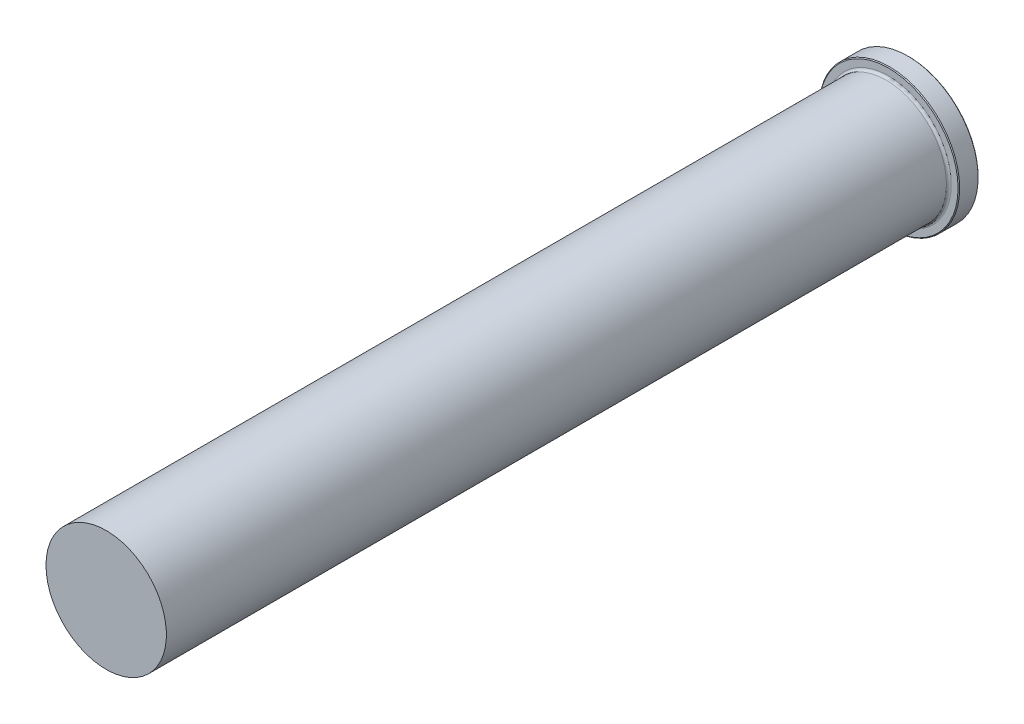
ISO-10303-21;
HEADER;
FILE_DESCRIPTION(('STEP AP214'),'2;1');
FILE_NAME('part.step','',(''),(''),'','','');
FILE_SCHEMA(('AUTOMOTIVE_DESIGN { 1 0 10303 214 1 1 1 1 }'));
ENDSEC;
DATA;
#1=APPLICATION_CONTEXT('core data for automotive mechanical design processes');
#2=APPLICATION_PROTOCOL_DEFINITION('international standard','automotive_design',2000,#1);
#3=PRODUCT_CONTEXT('',#1,'mechanical');
#4=PRODUCT('Part','Part','',(#3));
#5=PRODUCT_RELATED_PRODUCT_CATEGORY('part','',(#4));
#6=PRODUCT_DEFINITION_FORMATION('','',#4);
#7=PRODUCT_DEFINITION_CONTEXT('part definition',#1,'design');
#8=PRODUCT_DEFINITION('design','',#6,#7);
#9=PRODUCT_DEFINITION_SHAPE('','',#8);
#10=(LENGTH_UNIT() NAMED_UNIT(*) SI_UNIT(.MILLI.,.METRE.));
#11=(NAMED_UNIT(*) PLANE_ANGLE_UNIT() SI_UNIT($,.RADIAN.));
#12=(NAMED_UNIT(*) SI_UNIT($,.STERADIAN.) SOLID_ANGLE_UNIT());
#13=UNCERTAINTY_MEASURE_WITH_UNIT(LENGTH_MEASURE(1.E-05),#10,'distance_accuracy_value','');
#14=(GEOMETRIC_REPRESENTATION_CONTEXT(3) GLOBAL_UNCERTAINTY_ASSIGNED_CONTEXT((#13)) GLOBAL_UNIT_ASSIGNED_CONTEXT((#10,
#11,#12)) REPRESENTATION_CONTEXT('',''));
#15=CARTESIAN_POINT('',(0.,0.,0.));
#16=DIRECTION('',(0.,0.,1.));
#17=DIRECTION('',(1.,0.,0.));
#18=AXIS2_PLACEMENT_3D('',#15,#16,#17);
#19=CARTESIAN_POINT('',(0.,0.,0.));
#20=DIRECTION('',(0.,0.,-1.));
#21=DIRECTION('',(-1.,0.,0.));
#22=AXIS2_PLACEMENT_3D('',#19,#20,#21);
#23=PLANE('',#22);
#24=CARTESIAN_POINT('',(0.,0.,0.));
#25=DIRECTION('',(0.,0.,-1.));
#26=DIRECTION('',(-1.,0.,0.));
#27=AXIS2_PLACEMENT_3D('',#24,#25,#26);
#28=CIRCLE('',#27,21.971);
#29=CARTESIAN_POINT('',(-21.971,0.,0.));
#30=VERTEX_POINT('',#29);
#31=EDGE_CURVE('E50',#30,#30,#28,.T.);
#32=ORIENTED_EDGE('',*,*,#31,.T.);
#33=EDGE_LOOP('',(#32));
#34=FACE_BOUND('',#33,.T.);
#35=ADVANCED_FACE('F35',(#34),#23,.T.);
#36=CARTESIAN_POINT('',(0.,0.,0.));
#37=DIRECTION('',(0.,0.,-1.));
#38=DIRECTION('',(-1.,0.,0.));
#39=AXIS2_PLACEMENT_3D('',#36,#37,#38);
#40=CYLINDRICAL_SURFACE('',#39,22.225);
#41=CARTESIAN_POINT('',(0.,0.,0.254000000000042));
#42=DIRECTION('',(0.,0.,-1.));
#43=DIRECTION('',(-1.,0.,0.));
#44=AXIS2_PLACEMENT_3D('',#41,#42,#43);
#45=CIRCLE('',#44,22.225);
#46=CARTESIAN_POINT('',(-22.225,0.,0.254000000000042));
#47=VERTEX_POINT('',#46);
#48=EDGE_CURVE('E42',#47,#47,#45,.F.);
#49=ORIENTED_EDGE('',*,*,#48,.T.);
#50=EDGE_LOOP('',(#49));
#51=FACE_BOUND('',#50,.T.);
#52=CARTESIAN_POINT('',(0.,0.,6.09600000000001));
#53=DIRECTION('',(0.,0.,1.));
#54=DIRECTION('',(1.,0.,0.));
#55=AXIS2_PLACEMENT_3D('',#52,#53,#54);
#56=CIRCLE('',#55,22.225);
#57=CARTESIAN_POINT('',(22.225,0.,6.09600000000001));
#58=VERTEX_POINT('',#57);
#59=EDGE_CURVE('E46',#58,#58,#56,.F.);
#60=ORIENTED_EDGE('',*,*,#59,.T.);
#61=EDGE_LOOP('',(#60));
#62=FACE_BOUND('',#61,.T.);
#63=ADVANCED_FACE('F82',(#51,#62),#40,.T.);
#64=CARTESIAN_POINT('',(0.,22.225,6.35));
#65=DIRECTION('',(0.,0.,1.));
#66=DIRECTION('',(1.,0.,0.));
#67=AXIS2_PLACEMENT_3D('',#64,#65,#66);
#68=PLANE('',#67);
#69=CARTESIAN_POINT('',(0.,0.,6.35));
#70=DIRECTION('',(0.,0.,1.));
#71=DIRECTION('',(1.,0.,0.));
#72=AXIS2_PLACEMENT_3D('',#69,#70,#71);
#73=CIRCLE('',#72,21.971);
#74=CARTESIAN_POINT('',(21.971,0.,6.35));
#75=VERTEX_POINT('',#74);
#76=EDGE_CURVE('E10',#75,#75,#73,.T.);
#77=ORIENTED_EDGE('',*,*,#76,.T.);
#78=EDGE_LOOP('',(#77));
#79=FACE_BOUND('',#78,.T.);
#80=CARTESIAN_POINT('',(0.,0.,6.35));
#81=DIRECTION('',(0.,0.,1.));
#82=DIRECTION('',(1.,0.,0.));
#83=AXIS2_PLACEMENT_3D('',#80,#81,#82);
#84=CIRCLE('',#83,19.812);
#85=CARTESIAN_POINT('',(19.812,0.,6.35));
#86=VERTEX_POINT('',#85);
#87=EDGE_CURVE('E58',#86,#86,#84,.F.);
#88=ORIENTED_EDGE('',*,*,#87,.T.);
#89=EDGE_LOOP('',(#88));
#90=FACE_BOUND('',#89,.T.);
#91=ADVANCED_FACE('F78',(#79,#90),#68,.T.);
#92=CARTESIAN_POINT('',(0.,0.,0.));
#93=DIRECTION('',(0.,0.,-1.));
#94=DIRECTION('',(-1.,0.,0.));
#95=AXIS2_PLACEMENT_3D('',#92,#93,#94);
#96=CYLINDRICAL_SURFACE('',#95,19.05);
#97=CARTESIAN_POINT('',(0.,0.,7.112));
#98=DIRECTION('',(0.,0.,1.));
#99=DIRECTION('',(1.,0.,0.));
#100=AXIS2_PLACEMENT_3D('',#97,#98,#99);
#101=CIRCLE('',#100,19.05);
#102=CARTESIAN_POINT('',(19.05,0.,7.112));
#103=VERTEX_POINT('',#102);
#104=EDGE_CURVE('E55',#103,#103,#101,.T.);
#105=ORIENTED_EDGE('',*,*,#104,.T.);
#106=EDGE_LOOP('',(#105));
#107=FACE_BOUND('',#106,.T.);
#108=CARTESIAN_POINT('',(0.,0.,254.));
#109=DIRECTION('',(0.,0.,-1.));
#110=DIRECTION('',(-1.,0.,0.));
#111=AXIS2_PLACEMENT_3D('',#108,#109,#110);
#112=CIRCLE('',#111,19.05);
#113=CARTESIAN_POINT('',(-19.05,0.,254.));
#114=VERTEX_POINT('',#113);
#115=EDGE_CURVE('E61',#114,#114,#112,.T.);
#116=ORIENTED_EDGE('',*,*,#115,.T.);
#117=EDGE_LOOP('',(#116));
#118=FACE_BOUND('',#117,.T.);
#119=ADVANCED_FACE('F65',(#107,#118),#96,.T.);
#120=CARTESIAN_POINT('',(0.,19.05,254.));
#121=DIRECTION('',(0.,0.,1.));
#122=DIRECTION('',(1.,0.,0.));
#123=AXIS2_PLACEMENT_3D('',#120,#121,#122);
#124=PLANE('',#123);
#125=ORIENTED_EDGE('',*,*,#115,.F.);
#126=EDGE_LOOP('',(#125));
#127=FACE_BOUND('',#126,.T.);
#128=ADVANCED_FACE('F67',(#127),#124,.T.);
#129=CARTESIAN_POINT('',(0.,0.,7.112));
#130=DIRECTION('',(0.,0.,1.));
#131=DIRECTION('',(1.,0.,0.));
#132=AXIS2_PLACEMENT_3D('',#129,#130,#131);
#133=TOROIDAL_SURFACE('',#132,19.812,0.762);
#134=ORIENTED_EDGE('',*,*,#104,.F.);
#135=EDGE_LOOP('',(#134));
#136=FACE_BOUND('',#135,.T.);
#137=ORIENTED_EDGE('',*,*,#87,.F.);
#138=EDGE_LOOP('',(#137));
#139=FACE_BOUND('',#138,.T.);
#140=ADVANCED_FACE('F69',(#136,#139),#133,.F.);
#141=CARTESIAN_POINT('',(0.,0.,0.));
#142=DIRECTION('',(0.,0.,1.));
#143=DIRECTION('',(1.,0.,0.));
#144=AXIS2_PLACEMENT_3D('',#141,#142,#143);
#145=CONICAL_SURFACE('',#144,21.971,0.785398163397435);
#146=ORIENTED_EDGE('',*,*,#48,.F.);
#147=EDGE_LOOP('',(#146));
#148=FACE_BOUND('',#147,.T.);
#149=ORIENTED_EDGE('',*,*,#31,.F.);
#150=EDGE_LOOP('',(#149));
#151=FACE_BOUND('',#150,.T.);
#152=ADVANCED_FACE('F75',(#148,#151),#145,.T.);
#153=CARTESIAN_POINT('',(0.,0.,6.09600000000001));
#154=DIRECTION('',(0.,0.,-1.));
#155=DIRECTION('',(-1.,0.,0.));
#156=AXIS2_PLACEMENT_3D('',#153,#154,#155);
#157=CONICAL_SURFACE('',#156,22.225,0.785398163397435);
#158=ORIENTED_EDGE('',*,*,#76,.F.);
#159=EDGE_LOOP('',(#158));
#160=FACE_BOUND('',#159,.T.);
#161=ORIENTED_EDGE('',*,*,#59,.F.);
#162=EDGE_LOOP('',(#161));
#163=FACE_BOUND('',#162,.T.);
#164=ADVANCED_FACE('F37',(#160,#163),#157,.T.);
#165=CLOSED_SHELL('',(#35,#63,#91,#119,#128,#140,#152,#164));
#166=MANIFOLD_SOLID_BREP('B2',#165);
#167=ADVANCED_BREP_SHAPE_REPRESENTATION('',(#18,#166),#14);
#168=SHAPE_DEFINITION_REPRESENTATION(#9,#167);
ENDSEC;
END-ISO-10303-21;
